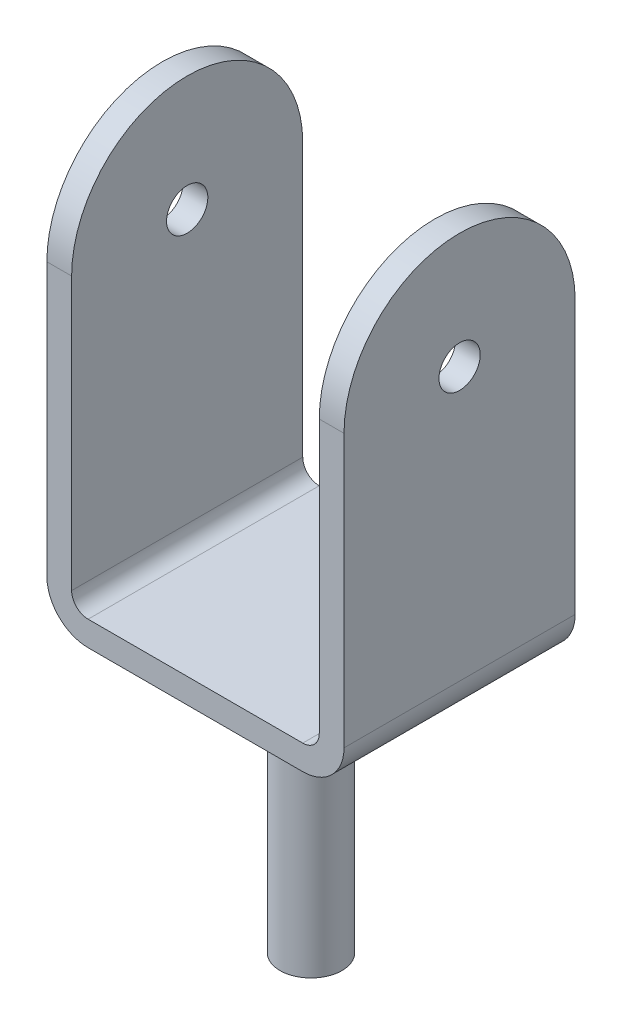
from build123d import *

# Parameters (mm, degrees)
BOSS_EXTRUDE1_DEPTH = 140
FILLET1_R           = 20
FILLET2_R           = 50
CUT_EXTRUDE2_REACH  = 649.765
CUT_EXTRUDE3_REACH  = 649.765
SKETCH4_R           = 25
SKETCH5_R           = 37.5
BOSS_EXTRUDE2_DEPTH = 325


with BuildPart() as part:
    # Sketch1 → Boss-Extrude1 (new, symmetric)
    with BuildSketch(Plane.XY):
        Polygon((-180, 0), (180, 0), (180, 520), (150, 520), (150, 30), (-150, 30), (-150, 520), (-180, 520), align=None)
    extrude(amount=BOSS_EXTRUDE1_DEPTH, both=True)

    # Fillet1
    fillet1_edges = [part.edges().sort_by_distance(p)[0] for p in [
        (-150, 30, 0),
        (150, 30, 0),
    ]]
    fillet(fillet1_edges, radius=FILLET1_R)

    # Fillet2
    fillet2_edges = [part.edges().sort_by_distance(p)[0] for p in [
        (180, 0, 0),
        (-180, 0, 0),
    ]]
    fillet(fillet2_edges, radius=FILLET2_R)

    # Cut-Extrude2: up to this face of the body (flat: up to its plane)
    cut_extrude2_end = Plane(part.part.faces().sort_by_distance((180, 285, 0))[0])
    # Sketch2 → Cut-Extrude2 (cut, up to the picked face)
    with BuildSketch(Plane.ZY.offset(180), mode=Mode.PRIVATE) as cut_extrude2_sk1:
        with BuildLine():
            Line((-140, 380), (-175, 380))
            Line((-175, 380), (-175, 580))
            Line((-175, 580), (175, 580))
            Line((175, 580), (175, 380))
            Line((175, 380), (140, 380))
            ThreePointArc((140, 380), (0, 520), (-140, 380))
        make_face()
    cut_extrude2_tool1 = split(extrude(cut_extrude2_sk1.sketch, amount=-CUT_EXTRUDE2_REACH, mode=Mode.PRIVATE), bisect_by=cut_extrude2_end, keep=Keep.BOTH, mode=Mode.PRIVATE)
    add(cut_extrude2_tool1.solids().sort_by(Axis((-180, 384.031129, -157.5), (1, 0, 0)))[0], mode=Mode.SUBTRACT)

    # Cut-Extrude3: up to this face of the body (flat: up to its plane)
    cut_extrude3_end = Plane(part.part.faces().sort_by_distance((180, 271.087529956, 0))[0])
    # Sketch4 → Cut-Extrude3 (cut, up to the picked face)
    with BuildSketch(Plane.ZY.offset(180), mode=Mode.PRIVATE) as cut_extrude3_sk1:
        with Locations((0, 380)):
            Circle(SKETCH4_R)
    cut_extrude3_tool1 = split(extrude(cut_extrude3_sk1.sketch, amount=-CUT_EXTRUDE3_REACH, mode=Mode.PRIVATE), bisect_by=cut_extrude3_end, keep=Keep.BOTH, mode=Mode.PRIVATE)
    add(cut_extrude3_tool1.solids().sort_by(Axis((-180, 380, 0), (1, 0, 0)))[0], mode=Mode.SUBTRACT)

    # Sketch5 → Boss-Extrude2 (add)
    with BuildSketch(Plane.XZ):
        with Locations(Location((0, 0, 0), (0, 0, 90))):
            Circle(SKETCH5_R)
    extrude(amount=BOSS_EXTRUDE2_DEPTH)


solid = part.part
